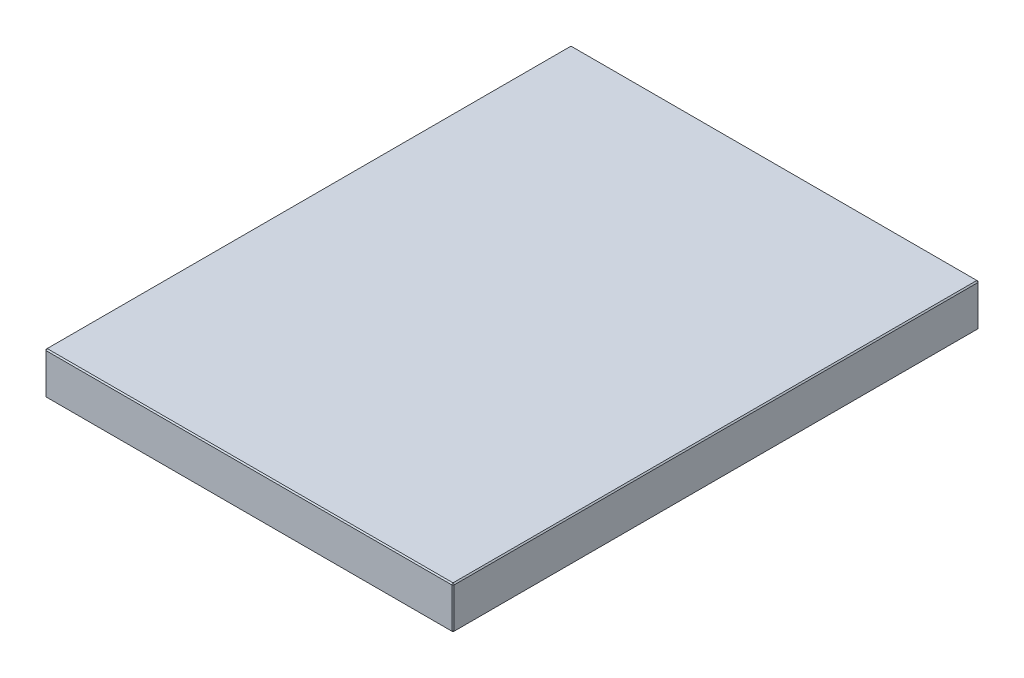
ISO-10303-21;
HEADER;
FILE_DESCRIPTION(('STEP AP214'),'2;1');
FILE_NAME('part.step','',(''),(''),'','','');
FILE_SCHEMA(('AUTOMOTIVE_DESIGN { 1 0 10303 214 1 1 1 1 }'));
ENDSEC;
DATA;
#1=APPLICATION_CONTEXT('core data for automotive mechanical design processes');
#2=APPLICATION_PROTOCOL_DEFINITION('international standard','automotive_design',2000,#1);
#3=PRODUCT_CONTEXT('',#1,'mechanical');
#4=PRODUCT('Part','Part','',(#3));
#5=PRODUCT_RELATED_PRODUCT_CATEGORY('part','',(#4));
#6=PRODUCT_DEFINITION_FORMATION('','',#4);
#7=PRODUCT_DEFINITION_CONTEXT('part definition',#1,'design');
#8=PRODUCT_DEFINITION('design','',#6,#7);
#9=PRODUCT_DEFINITION_SHAPE('','',#8);
#10=(LENGTH_UNIT() NAMED_UNIT(*) SI_UNIT(.MILLI.,.METRE.));
#11=(NAMED_UNIT(*) PLANE_ANGLE_UNIT() SI_UNIT($,.RADIAN.));
#12=(NAMED_UNIT(*) SI_UNIT($,.STERADIAN.) SOLID_ANGLE_UNIT());
#13=UNCERTAINTY_MEASURE_WITH_UNIT(LENGTH_MEASURE(1.E-05),#10,'distance_accuracy_value','');
#14=(GEOMETRIC_REPRESENTATION_CONTEXT(3) GLOBAL_UNCERTAINTY_ASSIGNED_CONTEXT((#13)) GLOBAL_UNIT_ASSIGNED_CONTEXT((#10,
#11,#12)) REPRESENTATION_CONTEXT('',''));
#15=CARTESIAN_POINT('',(0.,0.,0.));
#16=DIRECTION('',(0.,0.,1.));
#17=DIRECTION('',(1.,0.,0.));
#18=AXIS2_PLACEMENT_3D('',#15,#16,#17);
#19=CARTESIAN_POINT('',(173.,36.,223.));
#20=DIRECTION('',(-1.,0.,0.));
#21=DIRECTION('',(0.,0.,1.));
#22=AXIS2_PLACEMENT_3D('',#19,#20,#21);
#23=PLANE('',#22);
#24=DIRECTION('',(0.,0.,-1.));
#25=VECTOR('',#24,1.);
#26=CARTESIAN_POINT('',(173.,1.,-223.));
#27=LINE('',#26,#25);
#28=CARTESIAN_POINT('',(173.,1.,222.));
#29=VERTEX_POINT('',#28);
#30=CARTESIAN_POINT('',(173.,1.,-222.));
#31=VERTEX_POINT('',#30);
#32=EDGE_CURVE('E151',#29,#31,#27,.T.);
#33=ORIENTED_EDGE('',*,*,#32,.T.);
#34=DIRECTION('',(0.,1.,0.));
#35=VECTOR('',#34,1.);
#36=CARTESIAN_POINT('',(173.,36.,-222.));
#37=LINE('',#36,#35);
#38=CARTESIAN_POINT('',(173.,35.,-222.));
#39=VERTEX_POINT('',#38);
#40=EDGE_CURVE('E153',#31,#39,#37,.T.);
#41=ORIENTED_EDGE('',*,*,#40,.T.);
#42=DIRECTION('',(0.,0.,1.));
#43=VECTOR('',#42,1.);
#44=CARTESIAN_POINT('',(173.,35.,223.));
#45=LINE('',#44,#43);
#46=CARTESIAN_POINT('',(173.,35.,222.));
#47=VERTEX_POINT('',#46);
#48=EDGE_CURVE('E147',#39,#47,#45,.T.);
#49=ORIENTED_EDGE('',*,*,#48,.T.);
#50=DIRECTION('',(0.,-1.,0.));
#51=VECTOR('',#50,1.);
#52=CARTESIAN_POINT('',(173.,36.,222.));
#53=LINE('',#52,#51);
#54=EDGE_CURVE('E149',#47,#29,#53,.T.);
#55=ORIENTED_EDGE('',*,*,#54,.T.);
#56=EDGE_LOOP('',(#33,#41,#49,#55));
#57=FACE_BOUND('',#56,.T.);
#58=ADVANCED_FACE('F16',(#57),#23,.F.);
#59=CARTESIAN_POINT('',(-173.,36.,-223.));
#60=DIRECTION('',(0.,0.,1.));
#61=DIRECTION('',(1.,0.,0.));
#62=AXIS2_PLACEMENT_3D('',#59,#60,#61);
#63=PLANE('',#62);
#64=DIRECTION('',(0.,-1.,0.));
#65=VECTOR('',#64,1.);
#66=CARTESIAN_POINT('',(172.,36.,-223.));
#67=LINE('',#66,#65);
#68=CARTESIAN_POINT('',(172.,35.,-223.));
#69=VERTEX_POINT('',#68);
#70=CARTESIAN_POINT('',(172.,1.,-223.));
#71=VERTEX_POINT('',#70);
#72=EDGE_CURVE('E115',#69,#71,#67,.T.);
#73=ORIENTED_EDGE('',*,*,#72,.T.);
#74=DIRECTION('',(-1.,0.,0.));
#75=VECTOR('',#74,1.);
#76=CARTESIAN_POINT('',(-173.,1.,-223.));
#77=LINE('',#76,#75);
#78=CARTESIAN_POINT('',(-172.,1.,-223.));
#79=VERTEX_POINT('',#78);
#80=EDGE_CURVE('E111',#71,#79,#77,.T.);
#81=ORIENTED_EDGE('',*,*,#80,.T.);
#82=DIRECTION('',(0.,1.,0.));
#83=VECTOR('',#82,1.);
#84=CARTESIAN_POINT('',(-172.,36.,-223.));
#85=LINE('',#84,#83);
#86=CARTESIAN_POINT('',(-172.,35.,-223.));
#87=VERTEX_POINT('',#86);
#88=EDGE_CURVE('E103',#79,#87,#85,.T.);
#89=ORIENTED_EDGE('',*,*,#88,.T.);
#90=DIRECTION('',(1.,0.,0.));
#91=VECTOR('',#90,1.);
#92=CARTESIAN_POINT('',(-173.,35.,-223.));
#93=LINE('',#92,#91);
#94=EDGE_CURVE('E108',#87,#69,#93,.T.);
#95=ORIENTED_EDGE('',*,*,#94,.T.);
#96=EDGE_LOOP('',(#73,#81,#89,#95));
#97=FACE_BOUND('',#96,.T.);
#98=ADVANCED_FACE('F106',(#97),#63,.F.);
#99=CARTESIAN_POINT('',(-173.,36.,223.));
#100=DIRECTION('',(1.,0.,0.));
#101=DIRECTION('',(0.,0.,-1.));
#102=AXIS2_PLACEMENT_3D('',#99,#100,#101);
#103=PLANE('',#102);
#104=DIRECTION('',(0.,-1.,0.));
#105=VECTOR('',#104,1.);
#106=CARTESIAN_POINT('',(-173.,36.,-222.));
#107=LINE('',#106,#105);
#108=CARTESIAN_POINT('',(-173.,35.,-222.));
#109=VERTEX_POINT('',#108);
#110=CARTESIAN_POINT('',(-173.,1.,-222.));
#111=VERTEX_POINT('',#110);
#112=EDGE_CURVE('E123',#109,#111,#107,.T.);
#113=ORIENTED_EDGE('',*,*,#112,.T.);
#114=DIRECTION('',(0.,0.,1.));
#115=VECTOR('',#114,1.);
#116=CARTESIAN_POINT('',(-173.,1.,223.));
#117=LINE('',#116,#115);
#118=CARTESIAN_POINT('',(-173.,1.,222.));
#119=VERTEX_POINT('',#118);
#120=EDGE_CURVE('E161',#111,#119,#117,.T.);
#121=ORIENTED_EDGE('',*,*,#120,.T.);
#122=DIRECTION('',(0.,1.,0.));
#123=VECTOR('',#122,1.);
#124=CARTESIAN_POINT('',(-173.,36.,222.));
#125=LINE('',#124,#123);
#126=CARTESIAN_POINT('',(-173.,35.,222.));
#127=VERTEX_POINT('',#126);
#128=EDGE_CURVE('E158',#119,#127,#125,.T.);
#129=ORIENTED_EDGE('',*,*,#128,.T.);
#130=DIRECTION('',(0.,0.,-1.));
#131=VECTOR('',#130,1.);
#132=CARTESIAN_POINT('',(-173.,35.,223.));
#133=LINE('',#132,#131);
#134=EDGE_CURVE('E156',#127,#109,#133,.T.);
#135=ORIENTED_EDGE('',*,*,#134,.T.);
#136=EDGE_LOOP('',(#113,#121,#129,#135));
#137=FACE_BOUND('',#136,.T.);
#138=ADVANCED_FACE('F310',(#137),#103,.F.);
#139=CARTESIAN_POINT('',(-173.,36.,223.));
#140=DIRECTION('',(0.,0.,-1.));
#141=DIRECTION('',(-1.,0.,0.));
#142=AXIS2_PLACEMENT_3D('',#139,#140,#141);
#143=PLANE('',#142);
#144=DIRECTION('',(-1.,0.,0.));
#145=VECTOR('',#144,1.);
#146=CARTESIAN_POINT('',(-173.,35.,223.));
#147=LINE('',#146,#145);
#148=CARTESIAN_POINT('',(172.,35.,223.));
#149=VERTEX_POINT('',#148);
#150=CARTESIAN_POINT('',(-172.,35.,223.));
#151=VERTEX_POINT('',#150);
#152=EDGE_CURVE('E163',#149,#151,#147,.T.);
#153=ORIENTED_EDGE('',*,*,#152,.T.);
#154=DIRECTION('',(0.,-1.,0.));
#155=VECTOR('',#154,1.);
#156=CARTESIAN_POINT('',(-172.,36.,223.));
#157=LINE('',#156,#155);
#158=CARTESIAN_POINT('',(-172.,1.,223.));
#159=VERTEX_POINT('',#158);
#160=EDGE_CURVE('E169',#151,#159,#157,.T.);
#161=ORIENTED_EDGE('',*,*,#160,.T.);
#162=DIRECTION('',(1.,0.,0.));
#163=VECTOR('',#162,1.);
#164=CARTESIAN_POINT('',(173.,1.,223.));
#165=LINE('',#164,#163);
#166=CARTESIAN_POINT('',(172.,1.,223.));
#167=VERTEX_POINT('',#166);
#168=EDGE_CURVE('E167',#159,#167,#165,.T.);
#169=ORIENTED_EDGE('',*,*,#168,.T.);
#170=DIRECTION('',(0.,1.,0.));
#171=VECTOR('',#170,1.);
#172=CARTESIAN_POINT('',(172.,36.,223.));
#173=LINE('',#172,#171);
#174=EDGE_CURVE('E165',#167,#149,#173,.T.);
#175=ORIENTED_EDGE('',*,*,#174,.T.);
#176=EDGE_LOOP('',(#153,#161,#169,#175));
#177=FACE_BOUND('',#176,.T.);
#178=ADVANCED_FACE('F256',(#177),#143,.F.);
#179=CARTESIAN_POINT('',(0.,36.,0.));
#180=DIRECTION('',(0.,-1.,0.));
#181=DIRECTION('',(0.,0.,-1.));
#182=AXIS2_PLACEMENT_3D('',#179,#180,#181);
#183=PLANE('',#182);
#184=DIRECTION('',(0.,0.,1.));
#185=VECTOR('',#184,1.);
#186=CARTESIAN_POINT('',(-172.,36.,0.));
#187=LINE('',#186,#185);
#188=CARTESIAN_POINT('',(-172.,36.,-222.));
#189=VERTEX_POINT('',#188);
#190=CARTESIAN_POINT('',(-172.,36.,222.));
#191=VERTEX_POINT('',#190);
#192=EDGE_CURVE('E25',#189,#191,#187,.T.);
#193=ORIENTED_EDGE('',*,*,#192,.T.);
#194=DIRECTION('',(1.,0.,0.));
#195=VECTOR('',#194,1.);
#196=CARTESIAN_POINT('',(0.,36.,222.));
#197=LINE('',#196,#195);
#198=CARTESIAN_POINT('',(172.,36.,222.));
#199=VERTEX_POINT('',#198);
#200=EDGE_CURVE('E10',#191,#199,#197,.T.);
#201=ORIENTED_EDGE('',*,*,#200,.T.);
#202=DIRECTION('',(0.,0.,-1.));
#203=VECTOR('',#202,1.);
#204=CARTESIAN_POINT('',(172.,36.,0.));
#205=LINE('',#204,#203);
#206=CARTESIAN_POINT('',(172.,36.,-222.));
#207=VERTEX_POINT('',#206);
#208=EDGE_CURVE('E181',#199,#207,#205,.T.);
#209=ORIENTED_EDGE('',*,*,#208,.T.);
#210=DIRECTION('',(-1.,0.,0.));
#211=VECTOR('',#210,1.);
#212=CARTESIAN_POINT('',(0.,36.,-222.));
#213=LINE('',#212,#211);
#214=EDGE_CURVE('E36',#207,#189,#213,.T.);
#215=ORIENTED_EDGE('',*,*,#214,.T.);
#216=EDGE_LOOP('',(#193,#201,#209,#215));
#217=FACE_BOUND('',#216,.T.);
#218=ADVANCED_FACE('F271',(#217),#183,.F.);
#219=CARTESIAN_POINT('',(0.,0.,0.));
#220=DIRECTION('',(0.,-1.,0.));
#221=DIRECTION('',(0.,0.,-1.));
#222=AXIS2_PLACEMENT_3D('',#219,#220,#221);
#223=PLANE('',#222);
#224=DIRECTION('',(0.,0.,-1.));
#225=VECTOR('',#224,1.);
#226=CARTESIAN_POINT('',(-172.,0.,-223.));
#227=LINE('',#226,#225);
#228=CARTESIAN_POINT('',(-172.,0.,222.));
#229=VERTEX_POINT('',#228);
#230=CARTESIAN_POINT('',(-172.,0.,-222.));
#231=VERTEX_POINT('',#230);
#232=EDGE_CURVE('E176',#229,#231,#227,.T.);
#233=ORIENTED_EDGE('',*,*,#232,.T.);
#234=DIRECTION('',(1.,0.,0.));
#235=VECTOR('',#234,1.);
#236=CARTESIAN_POINT('',(173.,0.,-222.));
#237=LINE('',#236,#235);
#238=CARTESIAN_POINT('',(172.,0.,-222.));
#239=VERTEX_POINT('',#238);
#240=EDGE_CURVE('E178',#231,#239,#237,.T.);
#241=ORIENTED_EDGE('',*,*,#240,.T.);
#242=DIRECTION('',(0.,0.,1.));
#243=VECTOR('',#242,1.);
#244=CARTESIAN_POINT('',(172.,0.,223.));
#245=LINE('',#244,#243);
#246=CARTESIAN_POINT('',(172.,0.,222.));
#247=VERTEX_POINT('',#246);
#248=EDGE_CURVE('E172',#239,#247,#245,.T.);
#249=ORIENTED_EDGE('',*,*,#248,.T.);
#250=DIRECTION('',(-1.,0.,0.));
#251=VECTOR('',#250,1.);
#252=CARTESIAN_POINT('',(-173.,0.,222.));
#253=LINE('',#252,#251);
#254=EDGE_CURVE('E174',#247,#229,#253,.T.);
#255=ORIENTED_EDGE('',*,*,#254,.T.);
#256=EDGE_LOOP('',(#233,#241,#249,#255));
#257=FACE_BOUND('',#256,.T.);
#258=ADVANCED_FACE('F247',(#257),#223,.T.);
#259=CARTESIAN_POINT('',(-172.,36.,223.));
#260=DIRECTION('',(0.707106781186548,0.,-0.707106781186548));
#261=DIRECTION('',(0.,-1.,0.));
#262=AXIS2_PLACEMENT_3D('',#259,#260,#261);
#263=PLANE('',#262);
#264=DIRECTION('',(-0.707106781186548,0.,-0.707106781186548));
#265=VECTOR('',#264,1.);
#266=CARTESIAN_POINT('',(-173.,35.,222.));
#267=LINE('',#266,#265);
#268=EDGE_CURVE('E20',#127,#151,#267,.F.);
#269=ORIENTED_EDGE('',*,*,#268,.F.);
#270=ORIENTED_EDGE('',*,*,#128,.F.);
#271=DIRECTION('',(0.707106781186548,0.,0.707106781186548));
#272=VECTOR('',#271,1.);
#273=CARTESIAN_POINT('',(-172.,1.,223.));
#274=LINE('',#273,#272);
#275=EDGE_CURVE('E143',#159,#119,#274,.F.);
#276=ORIENTED_EDGE('',*,*,#275,.F.);
#277=ORIENTED_EDGE('',*,*,#160,.F.);
#278=EDGE_LOOP('',(#269,#270,#276,#277));
#279=FACE_BOUND('',#278,.T.);
#280=ADVANCED_FACE('F18',(#279),#263,.F.);
#281=CARTESIAN_POINT('',(-173.,35.,222.));
#282=DIRECTION('',(-0.577350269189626,0.577350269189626,0.577350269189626));
#283=DIRECTION('',(0.707106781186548,0.,0.707106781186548));
#284=AXIS2_PLACEMENT_3D('',#281,#282,#283);
#285=PLANE('',#284);
#286=DIRECTION('',(0.707106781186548,0.707106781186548,0.));
#287=VECTOR('',#286,1.);
#288=CARTESIAN_POINT('',(-173.,35.,222.));
#289=LINE('',#288,#287);
#290=EDGE_CURVE('E227',#127,#191,#289,.T.);
#291=ORIENTED_EDGE('',*,*,#290,.F.);
#292=ORIENTED_EDGE('',*,*,#268,.T.);
#293=DIRECTION('',(0.,-0.707106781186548,0.707106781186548));
#294=VECTOR('',#293,1.);
#295=CARTESIAN_POINT('',(-172.,35.5,222.5));
#296=LINE('',#295,#294);
#297=EDGE_CURVE('E229',#191,#151,#296,.T.);
#298=ORIENTED_EDGE('',*,*,#297,.F.);
#299=EDGE_LOOP('',(#291,#292,#298));
#300=FACE_BOUND('',#299,.T.);
#301=ADVANCED_FACE('F460',(#300),#285,.T.);
#302=CARTESIAN_POINT('',(-172.,1.,223.));
#303=DIRECTION('',(-0.577350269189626,-0.577350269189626,0.577350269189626));
#304=DIRECTION('',(0.707106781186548,0.,0.707106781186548));
#305=AXIS2_PLACEMENT_3D('',#302,#303,#304);
#306=PLANE('',#305);
#307=DIRECTION('',(0.,0.707106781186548,0.707106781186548));
#308=VECTOR('',#307,1.);
#309=CARTESIAN_POINT('',(-172.,1.,223.));
#310=LINE('',#309,#308);
#311=EDGE_CURVE('E221',#159,#229,#310,.F.);
#312=ORIENTED_EDGE('',*,*,#311,.F.);
#313=ORIENTED_EDGE('',*,*,#275,.T.);
#314=DIRECTION('',(0.707106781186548,-0.707106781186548,0.));
#315=VECTOR('',#314,1.);
#316=CARTESIAN_POINT('',(-172.5,0.5,222.));
#317=LINE('',#316,#315);
#318=EDGE_CURVE('E224',#229,#119,#317,.F.);
#319=ORIENTED_EDGE('',*,*,#318,.F.);
#320=EDGE_LOOP('',(#312,#313,#319));
#321=FACE_BOUND('',#320,.T.);
#322=ADVANCED_FACE('F236',(#321),#306,.T.);
#323=CARTESIAN_POINT('',(0.,36.,222.));
#324=DIRECTION('',(0.,-0.707106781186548,-0.707106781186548));
#325=DIRECTION('',(1.,0.,0.));
#326=AXIS2_PLACEMENT_3D('',#323,#324,#325);
#327=PLANE('',#326);
#328=ORIENTED_EDGE('',*,*,#297,.T.);
#329=ORIENTED_EDGE('',*,*,#152,.F.);
#330=DIRECTION('',(0.,0.707106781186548,-0.707106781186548));
#331=VECTOR('',#330,1.);
#332=CARTESIAN_POINT('',(172.,35.,223.));
#333=LINE('',#332,#331);
#334=EDGE_CURVE('E215',#199,#149,#333,.F.);
#335=ORIENTED_EDGE('',*,*,#334,.F.);
#336=ORIENTED_EDGE('',*,*,#200,.F.);
#337=EDGE_LOOP('',(#328,#329,#335,#336));
#338=FACE_BOUND('',#337,.T.);
#339=ADVANCED_FACE('F270',(#338),#327,.F.);
#340=CARTESIAN_POINT('',(-172.,36.,0.));
#341=DIRECTION('',(0.707106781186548,-0.707106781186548,0.));
#342=DIRECTION('',(0.,0.,1.));
#343=AXIS2_PLACEMENT_3D('',#340,#341,#342);
#344=PLANE('',#343);
#345=ORIENTED_EDGE('',*,*,#290,.T.);
#346=ORIENTED_EDGE('',*,*,#192,.F.);
#347=DIRECTION('',(-0.707106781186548,-0.707106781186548,0.));
#348=VECTOR('',#347,1.);
#349=CARTESIAN_POINT('',(-172.5,35.5,-222.));
#350=LINE('',#349,#348);
#351=EDGE_CURVE('E127',#109,#189,#350,.F.);
#352=ORIENTED_EDGE('',*,*,#351,.F.);
#353=ORIENTED_EDGE('',*,*,#134,.F.);
#354=EDGE_LOOP('',(#345,#346,#352,#353));
#355=FACE_BOUND('',#354,.T.);
#356=ADVANCED_FACE('F437',(#355),#344,.F.);
#357=CARTESIAN_POINT('',(-173.,36.,-222.));
#358=DIRECTION('',(0.707106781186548,0.,0.707106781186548));
#359=DIRECTION('',(0.,-1.,0.));
#360=AXIS2_PLACEMENT_3D('',#357,#358,#359);
#361=PLANE('',#360);
#362=DIRECTION('',(-0.707106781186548,0.,0.707106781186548));
#363=VECTOR('',#362,1.);
#364=CARTESIAN_POINT('',(-173.,1.,-222.));
#365=LINE('',#364,#363);
#366=EDGE_CURVE('E128',#111,#79,#365,.F.);
#367=ORIENTED_EDGE('',*,*,#366,.F.);
#368=ORIENTED_EDGE('',*,*,#112,.F.);
#369=DIRECTION('',(0.707106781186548,0.,-0.707106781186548));
#370=VECTOR('',#369,1.);
#371=CARTESIAN_POINT('',(-172.,35.,-223.));
#372=LINE('',#371,#370);
#373=EDGE_CURVE('E119',#87,#109,#372,.F.);
#374=ORIENTED_EDGE('',*,*,#373,.F.);
#375=ORIENTED_EDGE('',*,*,#88,.F.);
#376=EDGE_LOOP('',(#367,#368,#374,#375));
#377=FACE_BOUND('',#376,.T.);
#378=ADVANCED_FACE('F121',(#377),#361,.F.);
#379=CARTESIAN_POINT('',(-173.,1.,223.));
#380=DIRECTION('',(-0.707106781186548,-0.707106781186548,0.));
#381=DIRECTION('',(0.,0.,-1.));
#382=AXIS2_PLACEMENT_3D('',#379,#380,#381);
#383=PLANE('',#382);
#384=ORIENTED_EDGE('',*,*,#318,.T.);
#385=ORIENTED_EDGE('',*,*,#120,.F.);
#386=DIRECTION('',(-0.707106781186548,0.707106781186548,0.));
#387=VECTOR('',#386,1.);
#388=CARTESIAN_POINT('',(-173.,1.,-222.));
#389=LINE('',#388,#387);
#390=EDGE_CURVE('E211',#231,#111,#389,.T.);
#391=ORIENTED_EDGE('',*,*,#390,.F.);
#392=ORIENTED_EDGE('',*,*,#232,.F.);
#393=EDGE_LOOP('',(#384,#385,#391,#392));
#394=FACE_BOUND('',#393,.T.);
#395=ADVANCED_FACE('F243',(#394),#383,.T.);
#396=CARTESIAN_POINT('',(-173.,1.,223.));
#397=DIRECTION('',(0.,-0.707106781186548,0.707106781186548));
#398=DIRECTION('',(-1.,0.,0.));
#399=AXIS2_PLACEMENT_3D('',#396,#397,#398);
#400=PLANE('',#399);
#401=ORIENTED_EDGE('',*,*,#311,.T.);
#402=ORIENTED_EDGE('',*,*,#254,.F.);
#403=DIRECTION('',(0.,-0.707106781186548,-0.707106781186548));
#404=VECTOR('',#403,1.);
#405=CARTESIAN_POINT('',(172.,1.,223.));
#406=LINE('',#405,#404);
#407=EDGE_CURVE('E208',#167,#247,#406,.T.);
#408=ORIENTED_EDGE('',*,*,#407,.F.);
#409=ORIENTED_EDGE('',*,*,#168,.F.);
#410=EDGE_LOOP('',(#401,#402,#408,#409));
#411=FACE_BOUND('',#410,.T.);
#412=ADVANCED_FACE('F253',(#411),#400,.T.);
#413=CARTESIAN_POINT('',(173.,36.,222.));
#414=DIRECTION('',(-0.707106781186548,0.,-0.707106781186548));
#415=DIRECTION('',(0.,-1.,0.));
#416=AXIS2_PLACEMENT_3D('',#413,#414,#415);
#417=PLANE('',#416);
#418=DIRECTION('',(-0.707106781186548,0.,0.707106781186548));
#419=VECTOR('',#418,1.);
#420=CARTESIAN_POINT('',(172.,35.,223.));
#421=LINE('',#420,#419);
#422=EDGE_CURVE('E218',#149,#47,#421,.F.);
#423=ORIENTED_EDGE('',*,*,#422,.F.);
#424=ORIENTED_EDGE('',*,*,#174,.F.);
#425=DIRECTION('',(0.707106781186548,0.,-0.707106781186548));
#426=VECTOR('',#425,1.);
#427=CARTESIAN_POINT('',(172.,1.,223.));
#428=LINE('',#427,#426);
#429=EDGE_CURVE('E205',#29,#167,#428,.F.);
#430=ORIENTED_EDGE('',*,*,#429,.F.);
#431=ORIENTED_EDGE('',*,*,#54,.F.);
#432=EDGE_LOOP('',(#423,#424,#430,#431));
#433=FACE_BOUND('',#432,.T.);
#434=ADVANCED_FACE('F261',(#433),#417,.F.);
#435=CARTESIAN_POINT('',(172.,35.,223.));
#436=DIRECTION('',(0.577350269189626,0.577350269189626,0.577350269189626));
#437=DIRECTION('',(0.707106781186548,0.,-0.707106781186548));
#438=AXIS2_PLACEMENT_3D('',#435,#436,#437);
#439=PLANE('',#438);
#440=ORIENTED_EDGE('',*,*,#334,.T.);
#441=ORIENTED_EDGE('',*,*,#422,.T.);
#442=DIRECTION('',(0.707106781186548,-0.707106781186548,0.));
#443=VECTOR('',#442,1.);
#444=CARTESIAN_POINT('',(172.5,35.5,222.));
#445=LINE('',#444,#443);
#446=EDGE_CURVE('E134',#199,#47,#445,.T.);
#447=ORIENTED_EDGE('',*,*,#446,.F.);
#448=EDGE_LOOP('',(#440,#441,#447));
#449=FACE_BOUND('',#448,.T.);
#450=ADVANCED_FACE('F267',(#449),#439,.T.);
#451=CARTESIAN_POINT('',(-172.,35.,-223.));
#452=DIRECTION('',(-0.577350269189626,0.577350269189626,-0.577350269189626));
#453=DIRECTION('',(-0.707106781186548,0.,0.707106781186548));
#454=AXIS2_PLACEMENT_3D('',#451,#452,#453);
#455=PLANE('',#454);
#456=ORIENTED_EDGE('',*,*,#373,.T.);
#457=ORIENTED_EDGE('',*,*,#351,.T.);
#458=DIRECTION('',(0.,0.707106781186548,0.707106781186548));
#459=VECTOR('',#458,1.);
#460=CARTESIAN_POINT('',(-172.,35.,-223.));
#461=LINE('',#460,#459);
#462=EDGE_CURVE('E131',#87,#189,#461,.T.);
#463=ORIENTED_EDGE('',*,*,#462,.F.);
#464=EDGE_LOOP('',(#456,#457,#463));
#465=FACE_BOUND('',#464,.T.);
#466=ADVANCED_FACE('F132',(#465),#455,.T.);
#467=CARTESIAN_POINT('',(-173.,1.,-222.));
#468=DIRECTION('',(-0.577350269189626,-0.577350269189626,-0.577350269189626));
#469=DIRECTION('',(-0.707106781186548,0.,0.707106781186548));
#470=AXIS2_PLACEMENT_3D('',#467,#468,#469);
#471=PLANE('',#470);
#472=ORIENTED_EDGE('',*,*,#390,.T.);
#473=ORIENTED_EDGE('',*,*,#366,.T.);
#474=DIRECTION('',(0.,-0.707106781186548,0.707106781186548));
#475=VECTOR('',#474,1.);
#476=CARTESIAN_POINT('',(-172.,0.5,-222.5));
#477=LINE('',#476,#475);
#478=EDGE_CURVE('E135',#231,#79,#477,.F.);
#479=ORIENTED_EDGE('',*,*,#478,.F.);
#480=EDGE_LOOP('',(#472,#473,#479));
#481=FACE_BOUND('',#480,.T.);
#482=ADVANCED_FACE('F290',(#481),#471,.T.);
#483=CARTESIAN_POINT('',(172.,1.,223.));
#484=DIRECTION('',(0.577350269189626,-0.577350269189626,0.577350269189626));
#485=DIRECTION('',(0.707106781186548,0.,-0.707106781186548));
#486=AXIS2_PLACEMENT_3D('',#483,#484,#485);
#487=PLANE('',#486);
#488=ORIENTED_EDGE('',*,*,#429,.T.);
#489=ORIENTED_EDGE('',*,*,#407,.T.);
#490=DIRECTION('',(0.707106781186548,0.707106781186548,0.));
#491=VECTOR('',#490,1.);
#492=CARTESIAN_POINT('',(172.5,0.5,222.));
#493=LINE('',#492,#491);
#494=EDGE_CURVE('E198',#29,#247,#493,.F.);
#495=ORIENTED_EDGE('',*,*,#494,.F.);
#496=EDGE_LOOP('',(#488,#489,#495));
#497=FACE_BOUND('',#496,.T.);
#498=ADVANCED_FACE('F292',(#497),#487,.T.);
#499=CARTESIAN_POINT('',(172.,36.,0.));
#500=DIRECTION('',(-0.707106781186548,-0.707106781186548,0.));
#501=DIRECTION('',(0.,0.,-1.));
#502=AXIS2_PLACEMENT_3D('',#499,#500,#501);
#503=PLANE('',#502);
#504=ORIENTED_EDGE('',*,*,#446,.T.);
#505=ORIENTED_EDGE('',*,*,#48,.F.);
#506=DIRECTION('',(-0.707106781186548,0.707106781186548,0.));
#507=VECTOR('',#506,1.);
#508=CARTESIAN_POINT('',(173.,35.,-222.));
#509=LINE('',#508,#507);
#510=EDGE_CURVE('E195',#207,#39,#509,.F.);
#511=ORIENTED_EDGE('',*,*,#510,.F.);
#512=ORIENTED_EDGE('',*,*,#208,.F.);
#513=EDGE_LOOP('',(#504,#505,#511,#512));
#514=FACE_BOUND('',#513,.T.);
#515=ADVANCED_FACE('F275',(#514),#503,.F.);
#516=CARTESIAN_POINT('',(0.,36.,-222.));
#517=DIRECTION('',(0.,-0.707106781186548,0.707106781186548));
#518=DIRECTION('',(-1.,0.,0.));
#519=AXIS2_PLACEMENT_3D('',#516,#517,#518);
#520=PLANE('',#519);
#521=ORIENTED_EDGE('',*,*,#462,.T.);
#522=ORIENTED_EDGE('',*,*,#214,.F.);
#523=DIRECTION('',(0.,-0.707106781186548,-0.707106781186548));
#524=VECTOR('',#523,1.);
#525=CARTESIAN_POINT('',(172.,35.5,-222.5));
#526=LINE('',#525,#524);
#527=EDGE_CURVE('E139',#69,#207,#526,.F.);
#528=ORIENTED_EDGE('',*,*,#527,.F.);
#529=ORIENTED_EDGE('',*,*,#94,.F.);
#530=EDGE_LOOP('',(#521,#522,#528,#529));
#531=FACE_BOUND('',#530,.T.);
#532=ADVANCED_FACE('F137',(#531),#520,.F.);
#533=CARTESIAN_POINT('',(-173.,1.,-223.));
#534=DIRECTION('',(0.,-0.707106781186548,-0.707106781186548));
#535=DIRECTION('',(1.,0.,0.));
#536=AXIS2_PLACEMENT_3D('',#533,#534,#535);
#537=PLANE('',#536);
#538=ORIENTED_EDGE('',*,*,#478,.T.);
#539=ORIENTED_EDGE('',*,*,#80,.F.);
#540=DIRECTION('',(0.,0.707106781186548,-0.707106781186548));
#541=VECTOR('',#540,1.);
#542=CARTESIAN_POINT('',(172.,1.,-223.));
#543=LINE('',#542,#541);
#544=EDGE_CURVE('E191',#239,#71,#543,.T.);
#545=ORIENTED_EDGE('',*,*,#544,.F.);
#546=ORIENTED_EDGE('',*,*,#240,.F.);
#547=EDGE_LOOP('',(#538,#539,#545,#546));
#548=FACE_BOUND('',#547,.T.);
#549=ADVANCED_FACE('F288',(#548),#537,.T.);
#550=CARTESIAN_POINT('',(173.,1.,223.));
#551=DIRECTION('',(0.707106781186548,-0.707106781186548,0.));
#552=DIRECTION('',(0.,0.,1.));
#553=AXIS2_PLACEMENT_3D('',#550,#551,#552);
#554=PLANE('',#553);
#555=ORIENTED_EDGE('',*,*,#494,.T.);
#556=ORIENTED_EDGE('',*,*,#248,.F.);
#557=DIRECTION('',(-0.707106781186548,-0.707106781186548,0.));
#558=VECTOR('',#557,1.);
#559=CARTESIAN_POINT('',(172.5,0.5,-222.));
#560=LINE('',#559,#558);
#561=EDGE_CURVE('E189',#31,#239,#560,.T.);
#562=ORIENTED_EDGE('',*,*,#561,.F.);
#563=ORIENTED_EDGE('',*,*,#32,.F.);
#564=EDGE_LOOP('',(#555,#556,#562,#563));
#565=FACE_BOUND('',#564,.T.);
#566=ADVANCED_FACE('F320',(#565),#554,.T.);
#567=CARTESIAN_POINT('',(173.,35.,-222.));
#568=DIRECTION('',(0.577350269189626,0.577350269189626,-0.577350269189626));
#569=DIRECTION('',(-0.707106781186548,0.,-0.707106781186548));
#570=AXIS2_PLACEMENT_3D('',#567,#568,#569);
#571=PLANE('',#570);
#572=ORIENTED_EDGE('',*,*,#527,.T.);
#573=ORIENTED_EDGE('',*,*,#510,.T.);
#574=DIRECTION('',(0.707106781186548,0.,0.707106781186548));
#575=VECTOR('',#574,1.);
#576=CARTESIAN_POINT('',(173.,35.,-222.));
#577=LINE('',#576,#575);
#578=EDGE_CURVE('E187',#69,#39,#577,.T.);
#579=ORIENTED_EDGE('',*,*,#578,.F.);
#580=EDGE_LOOP('',(#572,#573,#579));
#581=FACE_BOUND('',#580,.T.);
#582=ADVANCED_FACE('F277',(#581),#571,.T.);
#583=CARTESIAN_POINT('',(172.,1.,-223.));
#584=DIRECTION('',(0.577350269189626,-0.577350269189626,-0.577350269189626));
#585=DIRECTION('',(-0.707106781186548,0.,-0.707106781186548));
#586=AXIS2_PLACEMENT_3D('',#583,#584,#585);
#587=PLANE('',#586);
#588=ORIENTED_EDGE('',*,*,#561,.T.);
#589=ORIENTED_EDGE('',*,*,#544,.T.);
#590=DIRECTION('',(-0.707106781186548,0.,-0.707106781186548));
#591=VECTOR('',#590,1.);
#592=CARTESIAN_POINT('',(172.,1.,-223.));
#593=LINE('',#592,#591);
#594=EDGE_CURVE('E185',#31,#71,#593,.T.);
#595=ORIENTED_EDGE('',*,*,#594,.F.);
#596=EDGE_LOOP('',(#588,#589,#595));
#597=FACE_BOUND('',#596,.T.);
#598=ADVANCED_FACE('F285',(#597),#587,.T.);
#599=CARTESIAN_POINT('',(172.,36.,-223.));
#600=DIRECTION('',(-0.707106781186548,0.,0.707106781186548));
#601=DIRECTION('',(0.,-1.,0.));
#602=AXIS2_PLACEMENT_3D('',#599,#600,#601);
#603=PLANE('',#602);
#604=ORIENTED_EDGE('',*,*,#578,.T.);
#605=ORIENTED_EDGE('',*,*,#40,.F.);
#606=ORIENTED_EDGE('',*,*,#594,.T.);
#607=ORIENTED_EDGE('',*,*,#72,.F.);
#608=EDGE_LOOP('',(#604,#605,#606,#607));
#609=FACE_BOUND('',#608,.T.);
#610=ADVANCED_FACE('F281',(#609),#603,.F.);
#611=CLOSED_SHELL('',(#58,#98,#138,#178,#218,#258,#280,#301,#322,#339,#356,#378,#395,#412,#434,
#450,#466,#482,#498,#515,#532,#549,#566,#582,#598,#610));
#612=MANIFOLD_SOLID_BREP('B1',#611);
#613=ADVANCED_BREP_SHAPE_REPRESENTATION('',(#18,#612),#14);
#614=SHAPE_DEFINITION_REPRESENTATION(#9,#613);
ENDSEC;
END-ISO-10303-21;
